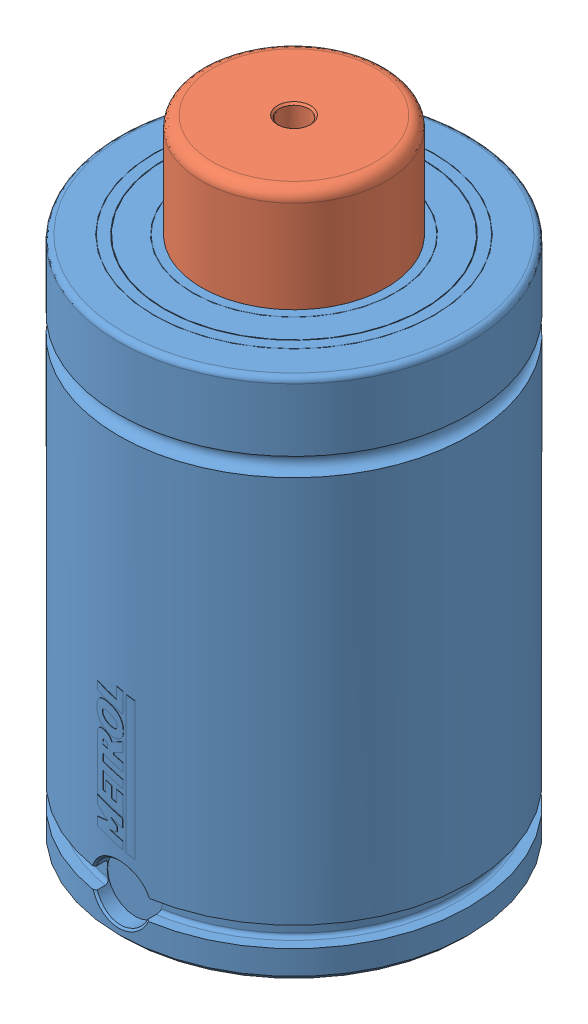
SolidWorks assembly ISNG3000-025.SLDASM, configuration Default (file format 7000). Lengths in mm.
Overall size (95 170 95.11).
2 component instances, 2 part files, 5 mates.
Components (placement in the parent):
- ISNG-3000 Body-1: ISNG-3000 Body.SLDPRT [ISNG-3000-25] x (0 0 1) z (0 -1 0) size (95.11 95 142)
- ISNG-3000 Piston-1: ISNG-3000 Piston.SLDPRT [ISNG-3000-25] at (0 117 0) x (0.491369 0 0.870951) z (0 -1 0) size (60 60 53)
Mates (geometry in assembly coordinates):
- Concentric1: concentric aligned: cylinder of ISNG-3000 Body-1 through (0 0 0) axis (0 -1 0) radius 25; cylinder of ISNG-3000 Piston-1 through (0 117 0) axis (0 -1 0) radius 25
- LimitDistance1: limit distance anti-aligned: plane of ISNG-3000 Piston-1 through (-26.1285 122 14.7411) normal (0 1 0); plane of ISNG-3000 Body-1 through (-25 122 0) normal (0 -1 0)
- Coincident1: coincident anti-aligned: plane of ISNG-3000 Body-1 through (0 0 0) normal (0 -1 0); plane of assembly through (0 0 0) normal (0 1 0)
- Coincident2: coincident anti-aligned: plane of ISNG-3000 Body-1; plane of assembly through (0 0 0) normal (1 0 0)
- Coincident6: coincident aligned: plane of ISNG-3000 Body-1; plane of assembly through (0 0 0) normal (0 0 1)
